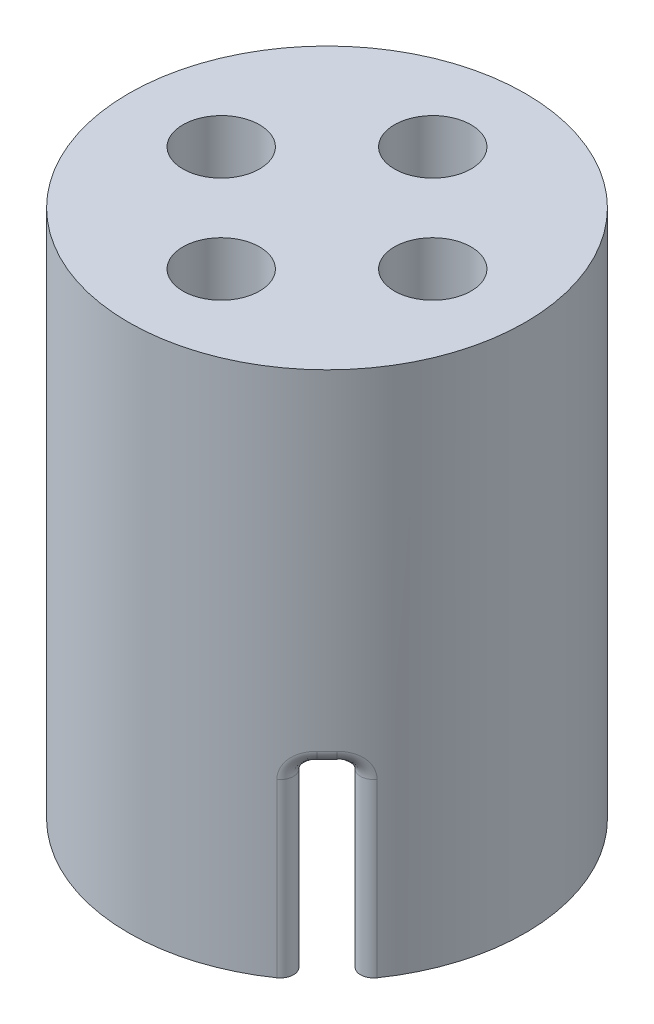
from build123d import *

# Parameters (mm, degrees)
SKETCH1_R           = 27.5
SKETCH1_R_2         = 1
SKETCH1_R_3         = 7.5
SKETCH1_R_4         = 0.9
BOSS_EXTRUDE1_DEPTH = 6
CUT_EXTRUDE1_START  = -2
SKETCH2_R           = 3.5
SKETCH2_R_2         = 1
CUT_EXTRUDE1_DEPTH  = 2
SKETCH3_R           = 1.9
CUT_EXTRUDE2_DEPTH  = 2
SKETCH4_R           = 7.5
SKETCH4_R_2         = 0.9
BOSS_EXTRUDE2_DEPTH = 20
CUT_EXTRUDE3_START  = -7
CUT_EXTRUDE3_DEPTH  = 7
FILLET2_R           = 0.5
SKETCH6_R           = 27.5
CUT_EXTRUDE4_DEPTH  = 6
SKETCH7_R           = 1.45
CUT_EXTRUDE5_DEPTH  = 59.298987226


with BuildPart() as part:
    # Sketch1 → Boss-Extrude1 (new body)
    # profile 1 of 2: a face of its own
    with BuildSketch(Plane(origin=(0, 0, 0), x_dir=(1, 0, 0), z_dir=(0, 1, 0))):
        with Locations(Location((-26.677300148, 35.286493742, 0), (0, 0, 270))):
            Circle(SKETCH1_R)
        with Locations(Location((-10.177300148, 35.286493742, 0), (0, 0, 270))):
            Circle(SKETCH1_R_2, mode=Mode.SUBTRACT)
        with Locations(Location((-26.677300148, 18.786493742, 0), (0, 0, 270))):
            Circle(SKETCH1_R_2, mode=Mode.SUBTRACT)
        with Locations(Location((-43.177300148, 35.286493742, 0), (0, 0, 270))):
            Circle(SKETCH1_R_2, mode=Mode.SUBTRACT)
        with Locations(Location((-26.677300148, 51.786493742, 0), (0, 0, 270))):
            Circle(SKETCH1_R_2, mode=Mode.SUBTRACT)
        with Locations((-26.677300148, 35.286493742)):
            Circle(SKETCH1_R_3, mode=Mode.SUBTRACT)
    # profile 2 of 2: a face of its own
    with BuildSketch(Plane(origin=(0, 0, 0), x_dir=(1, 0, 0), z_dir=(0, 1, 0))):
        with Locations((-26.677300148, 35.286493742)):
            Circle(SKETCH1_R_3)
        with Locations(Location((-30.677300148, 35.286493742, 0), (0, 0, 270))):
            Circle(SKETCH1_R_4, mode=Mode.SUBTRACT)
        with Locations(Location((-26.677300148, 31.286493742, 0), (0, 0, 270))):
            Circle(SKETCH1_R_4, mode=Mode.SUBTRACT)
        with Locations(Location((-22.677300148, 35.286493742, 0), (0, 0, 270))):
            Circle(SKETCH1_R_4, mode=Mode.SUBTRACT)
        with Locations(Location((-26.677300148, 39.286493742, 0), (0, 0, 270))):
            Circle(SKETCH1_R_4, mode=Mode.SUBTRACT)
    extrude(amount=-BOSS_EXTRUDE1_DEPTH)

    # Sketch2 → Cut-Extrude1 (cut)
    # profile 1 of 4: a face of its own
    with BuildSketch(Plane.XZ.offset(6).offset(CUT_EXTRUDE1_START)):
        with Locations(Location((-43.177300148, -35.286493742, 0), (0, 0, 270))):
            Circle(SKETCH2_R)
        with Locations(Location((-43.177300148, -35.286493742, 0), (0, 0, 90))):
            Circle(SKETCH2_R_2, mode=Mode.SUBTRACT)
    # profile 2 of 4: a face of its own
    with BuildSketch(Plane.XZ.offset(6).offset(CUT_EXTRUDE1_START)):
        with Locations(Location((-26.677300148, -18.786493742, 0), (0, 0, 270))):
            Circle(SKETCH2_R)
        with Locations(Location((-26.677300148, -18.786493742, 0), (0, 0, 90))):
            Circle(SKETCH2_R_2, mode=Mode.SUBTRACT)
    # profile 3 of 4: a face of its own
    with BuildSketch(Plane.XZ.offset(6).offset(CUT_EXTRUDE1_START)):
        with Locations(Location((-10.177300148, -35.286493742, 0), (0, 0, 270))):
            Circle(SKETCH2_R)
        with Locations(Location((-10.177300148, -35.286493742, 0), (0, 0, 90))):
            Circle(SKETCH2_R_2, mode=Mode.SUBTRACT)
    # profile 4 of 4: a face of its own
    with BuildSketch(Plane.XZ.offset(6).offset(CUT_EXTRUDE1_START)):
        with Locations(Location((-26.677300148, -51.786493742, 0), (0, 0, 270))):
            Circle(SKETCH2_R)
        with Locations(Location((-26.677300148, -51.786493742, 0), (0, 0, 90))):
            Circle(SKETCH2_R_2, mode=Mode.SUBTRACT)
    extrude(amount=CUT_EXTRUDE1_DEPTH, mode=Mode.SUBTRACT)

    # Sketch3 → Cut-Extrude2 (cut)
    with BuildSketch(Plane(origin=(0, 0, 0), x_dir=(1, 0, 0), z_dir=(0, 1, 0))):
        with Locations(Location((-26.677300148, 31.286493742, 0), (0, 0, 270))):
            Circle(SKETCH3_R)
        with Locations(Location((-22.677300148, 35.286493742, 0), (0, 0, 270))):
            Circle(SKETCH3_R)
        with Locations(Location((-30.677300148, 35.286493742, 0), (0, 0, 270))):
            Circle(SKETCH3_R)
        with Locations(Location((-26.677300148, 39.286493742, 0), (0, 0, 270))):
            Circle(SKETCH3_R)
    extrude(amount=-CUT_EXTRUDE2_DEPTH, mode=Mode.SUBTRACT)

    # Sketch4 → Boss-Extrude2 (add)
    with BuildSketch(Plane.XZ.offset(6)):
        with Locations(Location((-26.677300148, -35.286493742, 0), (0, 0, 90))):
            Circle(SKETCH4_R)
        with Locations(Location((-30.677300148, -35.286493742, 0), (0, 0, 90))):
            Circle(SKETCH4_R_2, mode=Mode.SUBTRACT)
        with Locations(Location((-26.677300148, -31.286493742, 0), (0, 0, 90))):
            Circle(SKETCH4_R_2, mode=Mode.SUBTRACT)
        with Locations(Location((-22.677300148, -35.286493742, 0), (0, 0, 90))):
            Circle(SKETCH4_R_2, mode=Mode.SUBTRACT)
        with Locations(Location((-26.677300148, -39.286493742, 0), (0, 0, 90))):
            Circle(SKETCH4_R_2, mode=Mode.SUBTRACT)
    extrude(amount=BOSS_EXTRUDE2_DEPTH)

    # Sketch5 → Cut-Extrude3 (cut)
    with BuildSketch(Plane.XZ.offset(26).offset(CUT_EXTRUDE3_START)):
        with BuildLine():
            ThreePointArc((-20.870252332, -30.540106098), (-21.373999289, -29.983192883), (-21.930912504, -29.479445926))
            Line((-21.930912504, -29.479445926), (-32.484347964, -40.032881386))
            ThreePointArc((-32.484347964, -40.032881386), (-31.980601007, -40.589794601), (-31.423687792, -41.093541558))
            Line((-31.423687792, -41.093541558), (-20.870252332, -30.540106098))
        make_face()
    extrude(amount=CUT_EXTRUDE3_DEPTH, mode=Mode.SUBTRACT)

    # Fillet2
    fillet2_edges = [part.edges().sort_by_distance(p)[0] for p in [
        (-20.870252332, -22.5, -30.540106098),
        (-31.980601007, -19, -40.589794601),
        (-31.423687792, -22.5, -41.093541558),
        (-27.207630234, -19, -34.756163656),
        (-32.484347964, -22.5, -40.032881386),
        (-21.373999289, -19, -29.983192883),
        (-21.930912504, -22.5, -29.479445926),
        (-26.146970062, -19, -35.816823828),
    ]]
    fillet(fillet2_edges, radius=FILLET2_R)

    # Sketch6 → Cut-Extrude4 (cut)
    with BuildSketch(Plane(origin=(0, 0, 0), x_dir=(1, 0, 0), z_dir=(0, 1, 0))):
        with Locations((-26.677300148, 35.286493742)):
            Circle(SKETCH6_R)
    extrude(amount=-CUT_EXTRUDE4_DEPTH, mode=Mode.SUBTRACT)

    # Sketch7 → Cut-Extrude5 (cut, through all)
    with BuildSketch(Plane(origin=(0, -6, 0), x_dir=(1, 0, 0), z_dir=(0, 1, 0))):
        with Locations(Location((-22.677300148, 35.286493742, 0), (0, 0, 270))):
            Circle(SKETCH7_R)
        with Locations(Location((-26.677300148, 31.286493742, 0), (0, 0, 270))):
            Circle(SKETCH7_R)
        with Locations(Location((-30.677300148, 35.286493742, 0), (0, 0, 270))):
            Circle(SKETCH7_R)
        with Locations(Location((-26.677300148, 39.286493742, 0), (0, 0, 270))):
            Circle(SKETCH7_R)
    extrude(amount=-CUT_EXTRUDE5_DEPTH, mode=Mode.SUBTRACT)


solid = part.part
